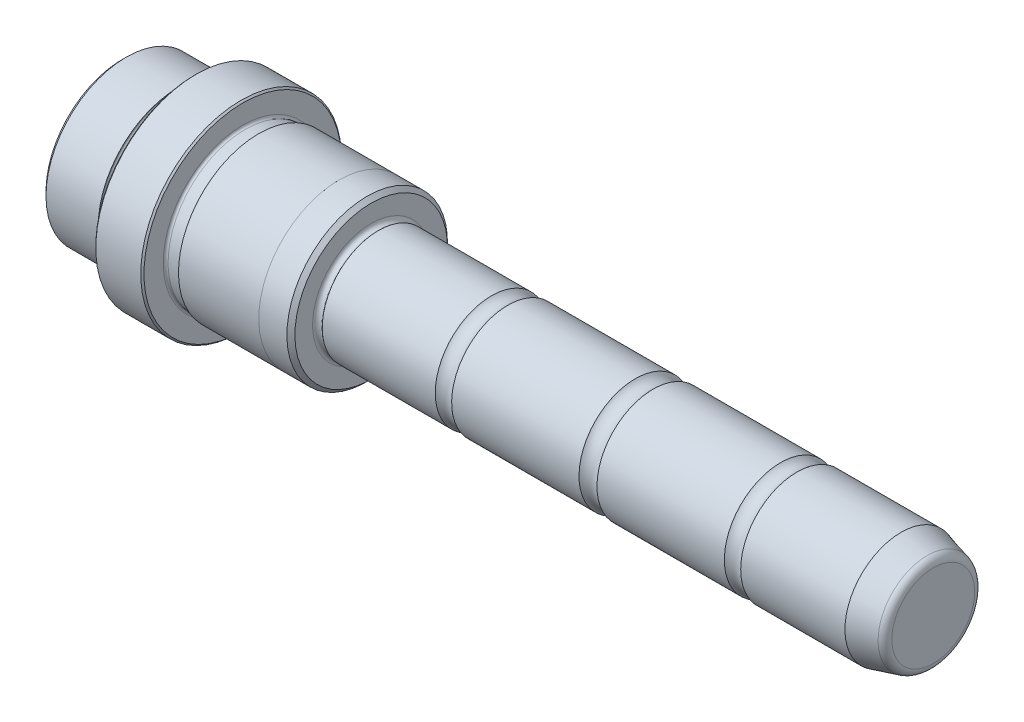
ISO-10303-21;
HEADER;
FILE_DESCRIPTION(('STEP AP214'),'2;1');
FILE_NAME('part.step','',(''),(''),'','','');
FILE_SCHEMA(('AUTOMOTIVE_DESIGN { 1 0 10303 214 1 1 1 1 }'));
ENDSEC;
DATA;
#1=APPLICATION_CONTEXT('core data for automotive mechanical design processes');
#2=APPLICATION_PROTOCOL_DEFINITION('international standard','automotive_design',2000,#1);
#3=PRODUCT_CONTEXT('',#1,'mechanical');
#4=PRODUCT('Part','Part','',(#3));
#5=PRODUCT_RELATED_PRODUCT_CATEGORY('part','',(#4));
#6=PRODUCT_DEFINITION_FORMATION('','',#4);
#7=PRODUCT_DEFINITION_CONTEXT('part definition',#1,'design');
#8=PRODUCT_DEFINITION('design','',#6,#7);
#9=PRODUCT_DEFINITION_SHAPE('','',#8);
#10=(LENGTH_UNIT() NAMED_UNIT(*) SI_UNIT(.MILLI.,.METRE.));
#11=(NAMED_UNIT(*) PLANE_ANGLE_UNIT() SI_UNIT($,.RADIAN.));
#12=(NAMED_UNIT(*) SI_UNIT($,.STERADIAN.) SOLID_ANGLE_UNIT());
#13=UNCERTAINTY_MEASURE_WITH_UNIT(LENGTH_MEASURE(1.E-05),#10,'distance_accuracy_value','');
#14=(GEOMETRIC_REPRESENTATION_CONTEXT(3) GLOBAL_UNCERTAINTY_ASSIGNED_CONTEXT((#13)) GLOBAL_UNIT_ASSIGNED_CONTEXT((#10,
#11,#12)) REPRESENTATION_CONTEXT('',''));
#15=CARTESIAN_POINT('',(0.,0.,0.));
#16=DIRECTION('',(0.,0.,1.));
#17=DIRECTION('',(1.,0.,0.));
#18=AXIS2_PLACEMENT_3D('',#15,#16,#17);
#19=CARTESIAN_POINT('',(70.,0.,0.));
#20=DIRECTION('',(1.,0.,0.));
#21=DIRECTION('',(0.,1.,0.));
#22=AXIS2_PLACEMENT_3D('',#19,#20,#21);
#23=CYLINDRICAL_SURFACE('',#22,6.99999999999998);
#24=CARTESIAN_POINT('',(0.899999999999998,0.,0.));
#25=DIRECTION('',(1.,0.,0.));
#26=DIRECTION('',(0.,1.,0.));
#27=AXIS2_PLACEMENT_3D('',#24,#25,#26);
#28=CIRCLE('',#27,6.99999999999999);
#29=CARTESIAN_POINT('',(0.899999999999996,6.99999999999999,0.));
#30=VERTEX_POINT('',#29);
#31=EDGE_CURVE('E105',#30,#30,#28,.T.);
#32=ORIENTED_EDGE('',*,*,#31,.T.);
#33=EDGE_LOOP('',(#32));
#34=FACE_BOUND('',#33,.T.);
#35=CARTESIAN_POINT('',(14.9801960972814,0.,0.));
#36=DIRECTION('',(-1.,0.,0.));
#37=DIRECTION('',(0.,-1.,0.));
#38=AXIS2_PLACEMENT_3D('',#35,#36,#37);
#39=CIRCLE('',#38,6.99999999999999);
#40=CARTESIAN_POINT('',(14.9801960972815,-6.99999999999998,0.));
#41=VERTEX_POINT('',#40);
#42=EDGE_CURVE('E126',#41,#41,#39,.T.);
#43=ORIENTED_EDGE('',*,*,#42,.T.);
#44=EDGE_LOOP('',(#43));
#45=FACE_BOUND('',#44,.T.);
#46=ADVANCED_FACE('F28',(#34,#45),#23,.T.);
#47=CARTESIAN_POINT('',(-31.,9.99999999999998,0.));
#48=DIRECTION('',(-1.,0.,0.));
#49=DIRECTION('',(0.,-1.,0.));
#50=AXIS2_PLACEMENT_3D('',#47,#48,#49);
#51=PLANE('',#50);
#52=CARTESIAN_POINT('',(-31.,0.,0.));
#53=DIRECTION('',(-1.,0.,0.));
#54=DIRECTION('',(0.,-1.,0.));
#55=AXIS2_PLACEMENT_3D('',#52,#53,#54);
#56=CIRCLE('',#55,9.49999999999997);
#57=CARTESIAN_POINT('',(-31.,-9.49999999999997,0.));
#58=VERTEX_POINT('',#57);
#59=EDGE_CURVE('E39',#58,#58,#56,.T.);
#60=ORIENTED_EDGE('',*,*,#59,.T.);
#61=EDGE_LOOP('',(#60));
#62=FACE_BOUND('',#61,.T.);
#63=ADVANCED_FACE('F149',(#62),#51,.T.);
#64=CARTESIAN_POINT('',(70.,0.,0.));
#65=DIRECTION('',(1.,0.,0.));
#66=DIRECTION('',(0.,1.,0.));
#67=AXIS2_PLACEMENT_3D('',#64,#65,#66);
#68=CYLINDRICAL_SURFACE('',#67,9.99999999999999);
#69=CARTESIAN_POINT('',(-30.5,0.,0.));
#70=DIRECTION('',(-1.,0.,0.));
#71=DIRECTION('',(0.,-1.,0.));
#72=AXIS2_PLACEMENT_3D('',#69,#70,#71);
#73=CIRCLE('',#72,9.99999999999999);
#74=CARTESIAN_POINT('',(-30.5,-9.99999999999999,0.));
#75=VERTEX_POINT('',#74);
#76=EDGE_CURVE('E43',#75,#75,#73,.F.);
#77=ORIENTED_EDGE('',*,*,#76,.T.);
#78=EDGE_LOOP('',(#77));
#79=FACE_BOUND('',#78,.T.);
#80=CARTESIAN_POINT('',(-24.,0.,0.));
#81=DIRECTION('',(1.,0.,0.));
#82=DIRECTION('',(0.,1.,0.));
#83=AXIS2_PLACEMENT_3D('',#80,#81,#82);
#84=CIRCLE('',#83,9.99999999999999);
#85=CARTESIAN_POINT('',(-24.,9.99999999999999,0.));
#86=VERTEX_POINT('',#85);
#87=EDGE_CURVE('E66',#86,#86,#84,.T.);
#88=ORIENTED_EDGE('',*,*,#87,.F.);
#89=EDGE_LOOP('',(#88));
#90=FACE_BOUND('',#89,.T.);
#91=ADVANCED_FACE('F157',(#79,#90),#68,.T.);
#92=CARTESIAN_POINT('',(-24.,9.89999999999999,0.));
#93=DIRECTION('',(1.,0.,0.));
#94=DIRECTION('',(0.,1.,0.));
#95=AXIS2_PLACEMENT_3D('',#92,#93,#94);
#96=PLANE('',#95);
#97=ORIENTED_EDGE('',*,*,#87,.T.);
#98=EDGE_LOOP('',(#97));
#99=FACE_BOUND('',#98,.T.);
#100=CARTESIAN_POINT('',(-24.,0.,0.));
#101=DIRECTION('',(1.,0.,0.));
#102=DIRECTION('',(0.,1.,0.));
#103=AXIS2_PLACEMENT_3D('',#100,#101,#102);
#104=CIRCLE('',#103,9.89999999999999);
#105=CARTESIAN_POINT('',(-24.,9.89999999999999,0.));
#106=VERTEX_POINT('',#105);
#107=EDGE_CURVE('E69',#106,#106,#104,.T.);
#108=ORIENTED_EDGE('',*,*,#107,.F.);
#109=EDGE_LOOP('',(#108));
#110=FACE_BOUND('',#109,.T.);
#111=ADVANCED_FACE('F405',(#99,#110),#96,.T.);
#112=CARTESIAN_POINT('',(-23.7,0.,0.));
#113=DIRECTION('',(1.,0.,0.));
#114=DIRECTION('',(0.,1.,0.));
#115=AXIS2_PLACEMENT_3D('',#112,#113,#114);
#116=TOROIDAL_SURFACE('',#115,9.89999999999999,0.299999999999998);
#117=ORIENTED_EDGE('',*,*,#107,.T.);
#118=EDGE_LOOP('',(#117));
#119=FACE_BOUND('',#118,.T.);
#120=CARTESIAN_POINT('',(-23.7,0.,0.));
#121=DIRECTION('',(1.,0.,0.));
#122=DIRECTION('',(0.,1.,0.));
#123=AXIS2_PLACEMENT_3D('',#120,#121,#122);
#124=CIRCLE('',#123,9.59999999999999);
#125=CARTESIAN_POINT('',(-23.7,9.59999999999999,0.));
#126=VERTEX_POINT('',#125);
#127=EDGE_CURVE('E72',#126,#126,#124,.T.);
#128=ORIENTED_EDGE('',*,*,#127,.F.);
#129=EDGE_LOOP('',(#128));
#130=FACE_BOUND('',#129,.T.);
#131=ADVANCED_FACE('F396',(#119,#130),#116,.F.);
#132=CARTESIAN_POINT('',(70.,0.,0.));
#133=DIRECTION('',(1.,0.,0.));
#134=DIRECTION('',(0.,1.,0.));
#135=AXIS2_PLACEMENT_3D('',#132,#133,#134);
#136=CYLINDRICAL_SURFACE('',#135,9.59999999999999);
#137=ORIENTED_EDGE('',*,*,#127,.T.);
#138=EDGE_LOOP('',(#137));
#139=FACE_BOUND('',#138,.T.);
#140=CARTESIAN_POINT('',(-22.3,0.,0.));
#141=DIRECTION('',(1.,0.,0.));
#142=DIRECTION('',(0.,1.,0.));
#143=AXIS2_PLACEMENT_3D('',#140,#141,#142);
#144=CIRCLE('',#143,9.59999999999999);
#145=CARTESIAN_POINT('',(-22.3,9.59999999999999,0.));
#146=VERTEX_POINT('',#145);
#147=EDGE_CURVE('E75',#146,#146,#144,.T.);
#148=ORIENTED_EDGE('',*,*,#147,.F.);
#149=EDGE_LOOP('',(#148));
#150=FACE_BOUND('',#149,.T.);
#151=ADVANCED_FACE('F387',(#139,#150),#136,.T.);
#152=CARTESIAN_POINT('',(-22.3,0.,0.));
#153=DIRECTION('',(1.,0.,0.));
#154=DIRECTION('',(0.,1.,0.));
#155=AXIS2_PLACEMENT_3D('',#152,#153,#154);
#156=TOROIDAL_SURFACE('',#155,9.89999999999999,0.300000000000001);
#157=ORIENTED_EDGE('',*,*,#147,.T.);
#158=EDGE_LOOP('',(#157));
#159=FACE_BOUND('',#158,.T.);
#160=CARTESIAN_POINT('',(-22.,0.,0.));
#161=DIRECTION('',(1.,0.,0.));
#162=DIRECTION('',(0.,1.,0.));
#163=AXIS2_PLACEMENT_3D('',#160,#161,#162);
#164=CIRCLE('',#163,9.89999999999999);
#165=CARTESIAN_POINT('',(-22.,9.89999999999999,0.));
#166=VERTEX_POINT('',#165);
#167=EDGE_CURVE('E78',#166,#166,#164,.T.);
#168=ORIENTED_EDGE('',*,*,#167,.F.);
#169=EDGE_LOOP('',(#168));
#170=FACE_BOUND('',#169,.T.);
#171=ADVANCED_FACE('F379',(#159,#170),#156,.F.);
#172=CARTESIAN_POINT('',(-22.,12.5,0.));
#173=DIRECTION('',(-1.,0.,0.));
#174=DIRECTION('',(0.,-1.,0.));
#175=AXIS2_PLACEMENT_3D('',#172,#173,#174);
#176=PLANE('',#175);
#177=CARTESIAN_POINT('',(-22.,0.,0.));
#178=DIRECTION('',(-1.,0.,0.));
#179=DIRECTION('',(0.,-1.,0.));
#180=AXIS2_PLACEMENT_3D('',#177,#178,#179);
#181=CIRCLE('',#180,12.3);
#182=CARTESIAN_POINT('',(-22.,-12.3,0.));
#183=VERTEX_POINT('',#182);
#184=EDGE_CURVE('E51',#183,#183,#181,.T.);
#185=ORIENTED_EDGE('',*,*,#184,.T.);
#186=EDGE_LOOP('',(#185));
#187=FACE_BOUND('',#186,.T.);
#188=ORIENTED_EDGE('',*,*,#167,.T.);
#189=EDGE_LOOP('',(#188));
#190=FACE_BOUND('',#189,.T.);
#191=ADVANCED_FACE('F371',(#187,#190),#176,.T.);
#192=CARTESIAN_POINT('',(70.,0.,0.));
#193=DIRECTION('',(1.,0.,0.));
#194=DIRECTION('',(0.,1.,0.));
#195=AXIS2_PLACEMENT_3D('',#192,#193,#194);
#196=CYLINDRICAL_SURFACE('',#195,12.5);
#197=CARTESIAN_POINT('',(-21.8000000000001,0.,0.));
#198=DIRECTION('',(-1.,0.,0.));
#199=DIRECTION('',(0.,-1.,0.));
#200=AXIS2_PLACEMENT_3D('',#197,#198,#199);
#201=CIRCLE('',#200,12.5);
#202=CARTESIAN_POINT('',(-21.8000000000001,-12.5,0.));
#203=VERTEX_POINT('',#202);
#204=EDGE_CURVE('E54',#203,#203,#201,.F.);
#205=ORIENTED_EDGE('',*,*,#204,.T.);
#206=EDGE_LOOP('',(#205));
#207=FACE_BOUND('',#206,.T.);
#208=CARTESIAN_POINT('',(-16.2,0.,0.));
#209=DIRECTION('',(1.,0.,0.));
#210=DIRECTION('',(0.,1.,0.));
#211=AXIS2_PLACEMENT_3D('',#208,#209,#210);
#212=CIRCLE('',#211,12.5);
#213=CARTESIAN_POINT('',(-16.2,12.5,0.));
#214=VERTEX_POINT('',#213);
#215=EDGE_CURVE('E57',#214,#214,#212,.F.);
#216=ORIENTED_EDGE('',*,*,#215,.T.);
#217=EDGE_LOOP('',(#216));
#218=FACE_BOUND('',#217,.T.);
#219=ADVANCED_FACE('F362',(#207,#218),#196,.T.);
#220=CARTESIAN_POINT('',(-16.,9.89999999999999,0.));
#221=DIRECTION('',(1.,0.,0.));
#222=DIRECTION('',(0.,1.,0.));
#223=AXIS2_PLACEMENT_3D('',#220,#221,#222);
#224=PLANE('',#223);
#225=CARTESIAN_POINT('',(-16.,0.,0.));
#226=DIRECTION('',(1.,0.,0.));
#227=DIRECTION('',(0.,1.,0.));
#228=AXIS2_PLACEMENT_3D('',#225,#226,#227);
#229=CIRCLE('',#228,12.3);
#230=CARTESIAN_POINT('',(-16.,12.3,0.));
#231=VERTEX_POINT('',#230);
#232=EDGE_CURVE('E48',#231,#231,#229,.T.);
#233=ORIENTED_EDGE('',*,*,#232,.T.);
#234=EDGE_LOOP('',(#233));
#235=FACE_BOUND('',#234,.T.);
#236=CARTESIAN_POINT('',(-16.,0.,0.));
#237=DIRECTION('',(1.,0.,0.));
#238=DIRECTION('',(0.,1.,0.));
#239=AXIS2_PLACEMENT_3D('',#236,#237,#238);
#240=CIRCLE('',#239,9.89999999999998);
#241=CARTESIAN_POINT('',(-16.,9.89999999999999,0.));
#242=VERTEX_POINT('',#241);
#243=EDGE_CURVE('E81',#242,#242,#240,.T.);
#244=ORIENTED_EDGE('',*,*,#243,.F.);
#245=EDGE_LOOP('',(#244));
#246=FACE_BOUND('',#245,.T.);
#247=ADVANCED_FACE('F353',(#235,#246),#224,.T.);
#248=CARTESIAN_POINT('',(-15.7,0.,0.));
#249=DIRECTION('',(1.,0.,0.));
#250=DIRECTION('',(0.,1.,0.));
#251=AXIS2_PLACEMENT_3D('',#248,#249,#250);
#252=TOROIDAL_SURFACE('',#251,9.89999999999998,0.3);
#253=ORIENTED_EDGE('',*,*,#243,.T.);
#254=EDGE_LOOP('',(#253));
#255=FACE_BOUND('',#254,.T.);
#256=CARTESIAN_POINT('',(-15.7,0.,0.));
#257=DIRECTION('',(1.,0.,0.));
#258=DIRECTION('',(0.,1.,0.));
#259=AXIS2_PLACEMENT_3D('',#256,#257,#258);
#260=CIRCLE('',#259,9.59999999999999);
#261=CARTESIAN_POINT('',(-15.7,9.59999999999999,0.));
#262=VERTEX_POINT('',#261);
#263=EDGE_CURVE('E84',#262,#262,#260,.T.);
#264=ORIENTED_EDGE('',*,*,#263,.F.);
#265=EDGE_LOOP('',(#264));
#266=FACE_BOUND('',#265,.T.);
#267=ADVANCED_FACE('F344',(#255,#266),#252,.F.);
#268=CARTESIAN_POINT('',(70.,0.,0.));
#269=DIRECTION('',(1.,0.,0.));
#270=DIRECTION('',(0.,1.,0.));
#271=AXIS2_PLACEMENT_3D('',#268,#269,#270);
#272=CYLINDRICAL_SURFACE('',#271,9.59999999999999);
#273=ORIENTED_EDGE('',*,*,#263,.T.);
#274=EDGE_LOOP('',(#273));
#275=FACE_BOUND('',#274,.T.);
#276=CARTESIAN_POINT('',(-14.3,0.,0.));
#277=DIRECTION('',(1.,0.,0.));
#278=DIRECTION('',(0.,1.,0.));
#279=AXIS2_PLACEMENT_3D('',#276,#277,#278);
#280=CIRCLE('',#279,9.59999999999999);
#281=CARTESIAN_POINT('',(-14.3,9.59999999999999,0.));
#282=VERTEX_POINT('',#281);
#283=EDGE_CURVE('E87',#282,#282,#280,.T.);
#284=ORIENTED_EDGE('',*,*,#283,.F.);
#285=EDGE_LOOP('',(#284));
#286=FACE_BOUND('',#285,.T.);
#287=ADVANCED_FACE('F335',(#275,#286),#272,.T.);
#288=CARTESIAN_POINT('',(-14.3,0.,0.));
#289=DIRECTION('',(1.,0.,0.));
#290=DIRECTION('',(0.,1.,0.));
#291=AXIS2_PLACEMENT_3D('',#288,#289,#290);
#292=TOROIDAL_SURFACE('',#291,9.89999999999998,0.3);
#293=ORIENTED_EDGE('',*,*,#283,.T.);
#294=EDGE_LOOP('',(#293));
#295=FACE_BOUND('',#294,.T.);
#296=CARTESIAN_POINT('',(-14.,0.,0.));
#297=DIRECTION('',(1.,0.,0.));
#298=DIRECTION('',(0.,1.,0.));
#299=AXIS2_PLACEMENT_3D('',#296,#297,#298);
#300=CIRCLE('',#299,9.89999999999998);
#301=CARTESIAN_POINT('',(-14.,9.89999999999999,0.));
#302=VERTEX_POINT('',#301);
#303=EDGE_CURVE('E90',#302,#302,#300,.T.);
#304=ORIENTED_EDGE('',*,*,#303,.F.);
#305=EDGE_LOOP('',(#304));
#306=FACE_BOUND('',#305,.T.);
#307=ADVANCED_FACE('F326',(#295,#306),#292,.F.);
#308=CARTESIAN_POINT('',(-14.,10.0001,0.));
#309=DIRECTION('',(-1.,0.,0.));
#310=DIRECTION('',(0.,-1.,0.));
#311=AXIS2_PLACEMENT_3D('',#308,#309,#310);
#312=PLANE('',#311);
#313=ORIENTED_EDGE('',*,*,#303,.T.);
#314=EDGE_LOOP('',(#313));
#315=FACE_BOUND('',#314,.T.);
#316=CARTESIAN_POINT('',(-14.,0.,0.));
#317=DIRECTION('',(1.,0.,0.));
#318=DIRECTION('',(0.,1.,0.));
#319=AXIS2_PLACEMENT_3D('',#316,#317,#318);
#320=CIRCLE('',#319,10.0001);
#321=CARTESIAN_POINT('',(-14.,10.0001,0.));
#322=VERTEX_POINT('',#321);
#323=EDGE_CURVE('E93',#322,#322,#320,.T.);
#324=ORIENTED_EDGE('',*,*,#323,.F.);
#325=EDGE_LOOP('',(#324));
#326=FACE_BOUND('',#325,.T.);
#327=ADVANCED_FACE('F317',(#315,#326),#312,.T.);
#328=CARTESIAN_POINT('',(70.,0.,0.));
#329=DIRECTION('',(1.,0.,0.));
#330=DIRECTION('',(0.,1.,0.));
#331=AXIS2_PLACEMENT_3D('',#328,#329,#330);
#332=CYLINDRICAL_SURFACE('',#331,10.0001);
#333=ORIENTED_EDGE('',*,*,#323,.T.);
#334=EDGE_LOOP('',(#333));
#335=FACE_BOUND('',#334,.T.);
#336=CARTESIAN_POINT('',(-4.,0.,0.));
#337=DIRECTION('',(1.,0.,0.));
#338=DIRECTION('',(0.,1.,0.));
#339=AXIS2_PLACEMENT_3D('',#336,#337,#338);
#340=CIRCLE('',#339,10.0001);
#341=CARTESIAN_POINT('',(-4.00000000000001,10.0001,0.));
#342=VERTEX_POINT('',#341);
#343=EDGE_CURVE('E96',#342,#342,#340,.T.);
#344=ORIENTED_EDGE('',*,*,#343,.F.);
#345=EDGE_LOOP('',(#344));
#346=FACE_BOUND('',#345,.T.);
#347=ADVANCED_FACE('F308',(#335,#346),#332,.T.);
#348=CARTESIAN_POINT('',(-4.,10.0001,0.));
#349=DIRECTION('',(1.,0.,0.));
#350=DIRECTION('',(0.,1.,0.));
#351=AXIS2_PLACEMENT_3D('',#348,#349,#350);
#352=PLANE('',#351);
#353=ORIENTED_EDGE('',*,*,#343,.T.);
#354=EDGE_LOOP('',(#353));
#355=FACE_BOUND('',#354,.T.);
#356=CARTESIAN_POINT('',(-4.,0.,0.));
#357=DIRECTION('',(1.,0.,0.));
#358=DIRECTION('',(0.,1.,0.));
#359=AXIS2_PLACEMENT_3D('',#356,#357,#358);
#360=CIRCLE('',#359,9.99999999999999);
#361=CARTESIAN_POINT('',(-4.00000000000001,10.,0.));
#362=VERTEX_POINT('',#361);
#363=EDGE_CURVE('E99',#362,#362,#360,.T.);
#364=ORIENTED_EDGE('',*,*,#363,.F.);
#365=EDGE_LOOP('',(#364));
#366=FACE_BOUND('',#365,.T.);
#367=ADVANCED_FACE('F300',(#355,#366),#352,.T.);
#368=CARTESIAN_POINT('',(70.,0.,0.));
#369=DIRECTION('',(1.,0.,0.));
#370=DIRECTION('',(0.,1.,0.));
#371=AXIS2_PLACEMENT_3D('',#368,#369,#370);
#372=CYLINDRICAL_SURFACE('',#371,9.99999999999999);
#373=CARTESIAN_POINT('',(-0.5,0.,0.));
#374=DIRECTION('',(1.,0.,0.));
#375=DIRECTION('',(0.,1.,0.));
#376=AXIS2_PLACEMENT_3D('',#373,#374,#375);
#377=CIRCLE('',#376,9.99999999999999);
#378=CARTESIAN_POINT('',(-0.500000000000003,10.,0.));
#379=VERTEX_POINT('',#378);
#380=EDGE_CURVE('E10',#379,#379,#377,.F.);
#381=ORIENTED_EDGE('',*,*,#380,.T.);
#382=EDGE_LOOP('',(#381));
#383=FACE_BOUND('',#382,.T.);
#384=ORIENTED_EDGE('',*,*,#363,.T.);
#385=EDGE_LOOP('',(#384));
#386=FACE_BOUND('',#385,.T.);
#387=ADVANCED_FACE('F292',(#383,#386),#372,.T.);
#388=CARTESIAN_POINT('',(0.,7.29999999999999,0.));
#389=DIRECTION('',(1.,0.,0.));
#390=DIRECTION('',(0.,1.,0.));
#391=AXIS2_PLACEMENT_3D('',#388,#389,#390);
#392=PLANE('',#391);
#393=CARTESIAN_POINT('',(0.,0.,0.));
#394=DIRECTION('',(1.,0.,0.));
#395=DIRECTION('',(0.,1.,0.));
#396=AXIS2_PLACEMENT_3D('',#393,#394,#395);
#397=CIRCLE('',#396,9.49999999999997);
#398=CARTESIAN_POINT('',(0.,9.49999999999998,0.));
#399=VERTEX_POINT('',#398);
#400=EDGE_CURVE('E35',#399,#399,#397,.T.);
#401=ORIENTED_EDGE('',*,*,#400,.T.);
#402=EDGE_LOOP('',(#401));
#403=FACE_BOUND('',#402,.T.);
#404=CARTESIAN_POINT('',(0.,0.,0.));
#405=DIRECTION('',(1.,0.,0.));
#406=DIRECTION('',(0.,1.,0.));
#407=AXIS2_PLACEMENT_3D('',#404,#405,#406);
#408=CIRCLE('',#407,7.29999999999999);
#409=CARTESIAN_POINT('',(0.,7.29999999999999,0.));
#410=VERTEX_POINT('',#409);
#411=EDGE_CURVE('E102',#410,#410,#408,.T.);
#412=ORIENTED_EDGE('',*,*,#411,.F.);
#413=EDGE_LOOP('',(#412));
#414=FACE_BOUND('',#413,.T.);
#415=ADVANCED_FACE('F144',(#403,#414),#392,.T.);
#416=CARTESIAN_POINT('',(0.5,0.,0.));
#417=DIRECTION('',(1.,0.,0.));
#418=DIRECTION('',(0.,1.,0.));
#419=AXIS2_PLACEMENT_3D('',#416,#417,#418);
#420=TOROIDAL_SURFACE('',#419,7.29999999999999,0.5);
#421=ORIENTED_EDGE('',*,*,#411,.T.);
#422=EDGE_LOOP('',(#421));
#423=FACE_BOUND('',#422,.T.);
#424=ORIENTED_EDGE('',*,*,#31,.F.);
#425=EDGE_LOOP('',(#424));
#426=FACE_BOUND('',#425,.T.);
#427=ADVANCED_FACE('F134',(#423,#426),#420,.F.);
#428=CARTESIAN_POINT('',(16.,0.,0.));
#429=DIRECTION('',(-1.,0.,0.));
#430=DIRECTION('',(0.,-1.,0.));
#431=AXIS2_PLACEMENT_3D('',#428,#429,#430);
#432=TOROIDAL_SURFACE('',#431,8.09999999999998,1.5);
#433=CARTESIAN_POINT('',(17.0198039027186,0.,0.));
#434=DIRECTION('',(-1.,0.,0.));
#435=DIRECTION('',(0.,-1.,0.));
#436=AXIS2_PLACEMENT_3D('',#433,#434,#435);
#437=CIRCLE('',#436,6.99999999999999);
#438=CARTESIAN_POINT('',(17.0198039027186,-6.99999999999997,0.));
#439=VERTEX_POINT('',#438);
#440=EDGE_CURVE('E123',#439,#439,#437,.T.);
#441=ORIENTED_EDGE('',*,*,#440,.T.);
#442=EDGE_LOOP('',(#441));
#443=FACE_BOUND('',#442,.T.);
#444=ORIENTED_EDGE('',*,*,#42,.F.);
#445=EDGE_LOOP('',(#444));
#446=FACE_BOUND('',#445,.T.);
#447=ADVANCED_FACE('F131',(#443,#446),#432,.F.);
#448=CARTESIAN_POINT('',(70.,5.92820323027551,0.));
#449=DIRECTION('',(1.,0.,0.));
#450=DIRECTION('',(0.,1.,0.));
#451=AXIS2_PLACEMENT_3D('',#448,#449,#450);
#452=PLANE('',#451);
#453=CARTESIAN_POINT('',(70.,0.,0.));
#454=DIRECTION('',(1.,0.,0.));
#455=DIRECTION('',(0.,1.,0.));
#456=AXIS2_PLACEMENT_3D('',#453,#454,#455);
#457=CIRCLE('',#456,5.16087624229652);
#458=CARTESIAN_POINT('',(70.,5.16087624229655,0.));
#459=VERTEX_POINT('',#458);
#460=EDGE_CURVE('E63',#459,#459,#457,.T.);
#461=ORIENTED_EDGE('',*,*,#460,.T.);
#462=EDGE_LOOP('',(#461));
#463=FACE_BOUND('',#462,.T.);
#464=ADVANCED_FACE('F133',(#463),#452,.T.);
#465=CARTESIAN_POINT('',(70.,0.,0.));
#466=DIRECTION('',(-1.,0.,0.));
#467=DIRECTION('',(0.,-1.,0.));
#468=AXIS2_PLACEMENT_3D('',#465,#466,#467);
#469=CONICAL_SURFACE('',#468,5.92820323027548,0.26179938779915);
#470=CARTESIAN_POINT('',(69.2588190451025,0.,0.));
#471=DIRECTION('',(1.,0.,0.));
#472=DIRECTION('',(0.,1.,0.));
#473=AXIS2_PLACEMENT_3D('',#470,#471,#472);
#474=CIRCLE('',#473,6.12680206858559);
#475=CARTESIAN_POINT('',(69.2588190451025,6.12680206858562,0.));
#476=VERTEX_POINT('',#475);
#477=EDGE_CURVE('E60',#476,#476,#474,.F.);
#478=ORIENTED_EDGE('',*,*,#477,.T.);
#479=EDGE_LOOP('',(#478));
#480=FACE_BOUND('',#479,.T.);
#481=CARTESIAN_POINT('',(66.,0.,0.));
#482=DIRECTION('',(1.,0.,0.));
#483=DIRECTION('',(0.,1.,0.));
#484=AXIS2_PLACEMENT_3D('',#481,#482,#483);
#485=CIRCLE('',#484,6.99999999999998);
#486=CARTESIAN_POINT('',(66.,7.,0.));
#487=VERTEX_POINT('',#486);
#488=EDGE_CURVE('E108',#487,#487,#485,.T.);
#489=ORIENTED_EDGE('',*,*,#488,.T.);
#490=EDGE_LOOP('',(#489));
#491=FACE_BOUND('',#490,.T.);
#492=ADVANCED_FACE('F141',(#480,#491),#469,.T.);
#493=ORIENTED_EDGE('',*,*,#488,.F.);
#494=EDGE_LOOP('',(#493));
#495=FACE_BOUND('',#494,.T.);
#496=CARTESIAN_POINT('',(53.0198039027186,0.,0.));
#497=DIRECTION('',(-1.,0.,0.));
#498=DIRECTION('',(0.,-1.,0.));
#499=AXIS2_PLACEMENT_3D('',#496,#497,#498);
#500=CIRCLE('',#499,6.99999999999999);
#501=CARTESIAN_POINT('',(53.0198039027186,-6.99999999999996,0.));
#502=VERTEX_POINT('',#501);
#503=EDGE_CURVE('E111',#502,#502,#500,.T.);
#504=ORIENTED_EDGE('',*,*,#503,.F.);
#505=EDGE_LOOP('',(#504));
#506=FACE_BOUND('',#505,.T.);
#507=ADVANCED_FACE('F153',(#495,#506),#23,.T.);
#508=CARTESIAN_POINT('',(52.,0.,0.));
#509=DIRECTION('',(-1.,0.,0.));
#510=DIRECTION('',(0.,-1.,0.));
#511=AXIS2_PLACEMENT_3D('',#508,#509,#510);
#512=TOROIDAL_SURFACE('',#511,8.09999999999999,1.5);
#513=ORIENTED_EDGE('',*,*,#503,.T.);
#514=EDGE_LOOP('',(#513));
#515=FACE_BOUND('',#514,.T.);
#516=CARTESIAN_POINT('',(50.9801960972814,0.,0.));
#517=DIRECTION('',(-1.,0.,0.));
#518=DIRECTION('',(0.,-1.,0.));
#519=AXIS2_PLACEMENT_3D('',#516,#517,#518);
#520=CIRCLE('',#519,6.99999999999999);
#521=CARTESIAN_POINT('',(50.9801960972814,-6.99999999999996,0.));
#522=VERTEX_POINT('',#521);
#523=EDGE_CURVE('E114',#522,#522,#520,.T.);
#524=ORIENTED_EDGE('',*,*,#523,.F.);
#525=EDGE_LOOP('',(#524));
#526=FACE_BOUND('',#525,.T.);
#527=ADVANCED_FACE('F167',(#515,#526),#512,.F.);
#528=ORIENTED_EDGE('',*,*,#523,.T.);
#529=EDGE_LOOP('',(#528));
#530=FACE_BOUND('',#529,.T.);
#531=CARTESIAN_POINT('',(35.1180339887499,0.,0.));
#532=DIRECTION('',(-1.,0.,0.));
#533=DIRECTION('',(0.,-1.,0.));
#534=AXIS2_PLACEMENT_3D('',#531,#532,#533);
#535=CIRCLE('',#534,6.99999999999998);
#536=CARTESIAN_POINT('',(35.1180339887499,-6.99999999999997,0.));
#537=VERTEX_POINT('',#536);
#538=EDGE_CURVE('E117',#537,#537,#535,.T.);
#539=ORIENTED_EDGE('',*,*,#538,.F.);
#540=EDGE_LOOP('',(#539));
#541=FACE_BOUND('',#540,.T.);
#542=ADVANCED_FACE('F165',(#530,#541),#23,.T.);
#543=CARTESIAN_POINT('',(34.,0.,0.));
#544=DIRECTION('',(-1.,0.,0.));
#545=DIRECTION('',(0.,-1.,0.));
#546=AXIS2_PLACEMENT_3D('',#543,#544,#545);
#547=TOROIDAL_SURFACE('',#546,7.99999999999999,1.5);
#548=ORIENTED_EDGE('',*,*,#538,.T.);
#549=EDGE_LOOP('',(#548));
#550=FACE_BOUND('',#549,.T.);
#551=CARTESIAN_POINT('',(32.8819660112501,0.,0.));
#552=DIRECTION('',(-1.,0.,0.));
#553=DIRECTION('',(0.,-1.,0.));
#554=AXIS2_PLACEMENT_3D('',#551,#552,#553);
#555=CIRCLE('',#554,6.99999999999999);
#556=CARTESIAN_POINT('',(32.8819660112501,-6.99999999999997,0.));
#557=VERTEX_POINT('',#556);
#558=EDGE_CURVE('E120',#557,#557,#555,.T.);
#559=ORIENTED_EDGE('',*,*,#558,.F.);
#560=EDGE_LOOP('',(#559));
#561=FACE_BOUND('',#560,.T.);
#562=ADVANCED_FACE('F163',(#550,#561),#547,.F.);
#563=ORIENTED_EDGE('',*,*,#558,.T.);
#564=EDGE_LOOP('',(#563));
#565=FACE_BOUND('',#564,.T.);
#566=ORIENTED_EDGE('',*,*,#440,.F.);
#567=EDGE_LOOP('',(#566));
#568=FACE_BOUND('',#567,.T.);
#569=ADVANCED_FACE('F152',(#565,#568),#23,.T.);
#570=CARTESIAN_POINT('',(69.,0.,0.));
#571=DIRECTION('',(1.,0.,0.));
#572=DIRECTION('',(0.,1.,0.));
#573=AXIS2_PLACEMENT_3D('',#570,#571,#572);
#574=TOROIDAL_SURFACE('',#573,5.16087624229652,1.);
#575=ORIENTED_EDGE('',*,*,#477,.F.);
#576=EDGE_LOOP('',(#575));
#577=FACE_BOUND('',#576,.T.);
#578=ORIENTED_EDGE('',*,*,#460,.F.);
#579=EDGE_LOOP('',(#578));
#580=FACE_BOUND('',#579,.T.);
#581=ADVANCED_FACE('F162',(#577,#580),#574,.T.);
#582=CARTESIAN_POINT('',(-21.8000000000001,0.,0.));
#583=DIRECTION('',(1.,0.,0.));
#584=DIRECTION('',(0.,1.,0.));
#585=AXIS2_PLACEMENT_3D('',#582,#583,#584);
#586=CONICAL_SURFACE('',#585,12.5,0.785398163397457);
#587=ORIENTED_EDGE('',*,*,#184,.F.);
#588=EDGE_LOOP('',(#587));
#589=FACE_BOUND('',#588,.T.);
#590=ORIENTED_EDGE('',*,*,#204,.F.);
#591=EDGE_LOOP('',(#590));
#592=FACE_BOUND('',#591,.T.);
#593=ADVANCED_FACE('F205',(#589,#592),#586,.T.);
#594=CARTESIAN_POINT('',(-16.,0.,0.));
#595=DIRECTION('',(-1.,0.,0.));
#596=DIRECTION('',(0.,-1.,0.));
#597=AXIS2_PLACEMENT_3D('',#594,#595,#596);
#598=CONICAL_SURFACE('',#597,12.3,0.785398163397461);
#599=ORIENTED_EDGE('',*,*,#215,.F.);
#600=EDGE_LOOP('',(#599));
#601=FACE_BOUND('',#600,.T.);
#602=ORIENTED_EDGE('',*,*,#232,.F.);
#603=EDGE_LOOP('',(#602));
#604=FACE_BOUND('',#603,.T.);
#605=ADVANCED_FACE('F215',(#601,#604),#598,.T.);
#606=CARTESIAN_POINT('',(-30.5,0.,0.));
#607=DIRECTION('',(1.,0.,0.));
#608=DIRECTION('',(0.,1.,0.));
#609=AXIS2_PLACEMENT_3D('',#606,#607,#608);
#610=CONICAL_SURFACE('',#609,9.99999999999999,0.785398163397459);
#611=ORIENTED_EDGE('',*,*,#59,.F.);
#612=EDGE_LOOP('',(#611));
#613=FACE_BOUND('',#612,.T.);
#614=ORIENTED_EDGE('',*,*,#76,.F.);
#615=EDGE_LOOP('',(#614));
#616=FACE_BOUND('',#615,.T.);
#617=ADVANCED_FACE('F224',(#613,#616),#610,.T.);
#618=CARTESIAN_POINT('',(0.,0.,0.));
#619=DIRECTION('',(-1.,0.,0.));
#620=DIRECTION('',(0.,-1.,0.));
#621=AXIS2_PLACEMENT_3D('',#618,#619,#620);
#622=CONICAL_SURFACE('',#621,9.49999999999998,0.78539816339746);
#623=ORIENTED_EDGE('',*,*,#380,.F.);
#624=EDGE_LOOP('',(#623));
#625=FACE_BOUND('',#624,.T.);
#626=ORIENTED_EDGE('',*,*,#400,.F.);
#627=EDGE_LOOP('',(#626));
#628=FACE_BOUND('',#627,.T.);
#629=ADVANCED_FACE('F30',(#625,#628),#622,.T.);
#630=CLOSED_SHELL('',(#46,#63,#91,#111,#131,#151,#171,#191,#219,#247,#267,#287,#307,#327,#347,
#367,#387,#415,#427,#447,#464,#492,#507,#527,#542,#562,#569,#581,#593,#605,#617,#629));
#631=MANIFOLD_SOLID_BREP('B2',#630);
#632=ADVANCED_BREP_SHAPE_REPRESENTATION('',(#18,#631),#14);
#633=SHAPE_DEFINITION_REPRESENTATION(#9,#632);
ENDSEC;
END-ISO-10303-21;
